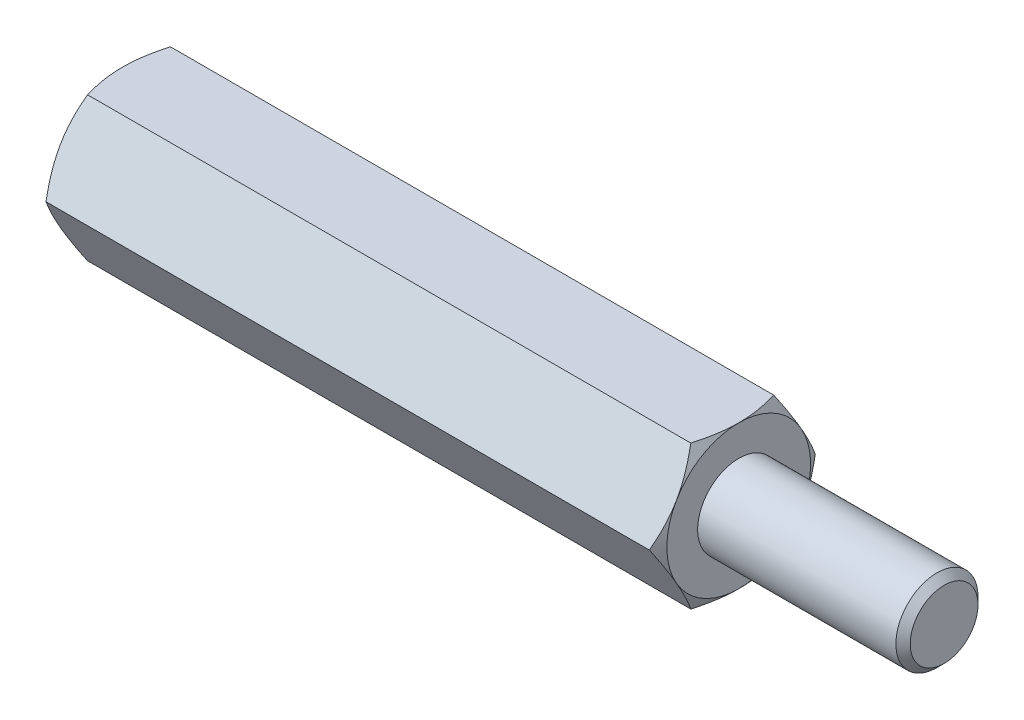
from build123d import *

# Parameters (mm, degrees)
EXTRUDE2_DEPTH = 15
SKETCH3_R      = 1.65
EXTRUDE3_DEPTH = 10
SKETCH5_R      = 2
EXTRUDE4_DEPTH = 10
CHAMFER1_SIZE  = 0.35


with BuildPart() as part:
    # Sketch1 → Extrude2 (new, symmetric)
    with BuildSketch(Plane(origin=(0, 0, 0), x_dir=(0, 0, -1), z_dir=(1, 0, 0))):
        Polygon((2.020725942, 3.5), (-2.020725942, 3.5), (-4.041451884, 0), (-2.020725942, -3.5), (2.020725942, -3.5), (4.041451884, 0), align=None)
    extrude(amount=EXTRUDE2_DEPTH, both=True)

    # Sketch2 → Cut-Revolve1 (revolve, cut)
    with BuildSketch(Plane.XY):
        with BuildLine():
            Line((-15, 3.5), (-13.5, 6.098076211))
            ThreePointArc((-13.5, 6.098076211), (-13.98810136, 7.276457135), (-15, 6.5))
            Line((-15, 6.5), (-15, 3.5))
        make_face()
    cut_revolve1 = revolve(axis=Axis((0, 0, 0), (1, 0, 0)), mode=Mode.SUBTRACT)

    # Mirror1: Cut-Revolve1 across plane
    add(cut_revolve1.mirror(Plane(origin=(0, 0, 0), x_dir=(0, 0, 1), z_dir=(1, 0, 0))), mode=Mode.SUBTRACT)

    # Sketch3 → Extrude3 (cut)
    with BuildSketch(Plane.ZY.offset(15)):
        Circle(SKETCH3_R)
    extrude(amount=-EXTRUDE3_DEPTH, mode=Mode.SUBTRACT)

    # Sketch4 → Cut-Revolve2 (revolve, cut)
    with BuildSketch(Plane.XY, mode=Mode.PRIVATE) as cut_revolve2_sk:
        Polygon((-5, 0), (-5, 1.65), (-4.047372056, 0), align=None)
    revolve(cut_revolve2_sk.sketch.rotate(Axis((-4.047372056, 0, 0), (-1, 0, 0)), 270), axis=Axis((-4.047372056, 0, 0), (-1, 0, 0)), mode=Mode.SUBTRACT)

    # Sketch5 → Extrude4 (add)
    with BuildSketch(Plane(origin=(15, 0, 0), x_dir=(0, 0, -1), z_dir=(1, 0, 0))):
        Circle(SKETCH5_R)
    extrude(amount=EXTRUDE4_DEPTH)

    # Chamfer1
    chamfer1_edges = [part.edges().sort_by_distance(p)[0] for p in [
        (25, 0, 2),
    ]]
    chamfer(chamfer1_edges, length=CHAMFER1_SIZE)


solid = part.part
